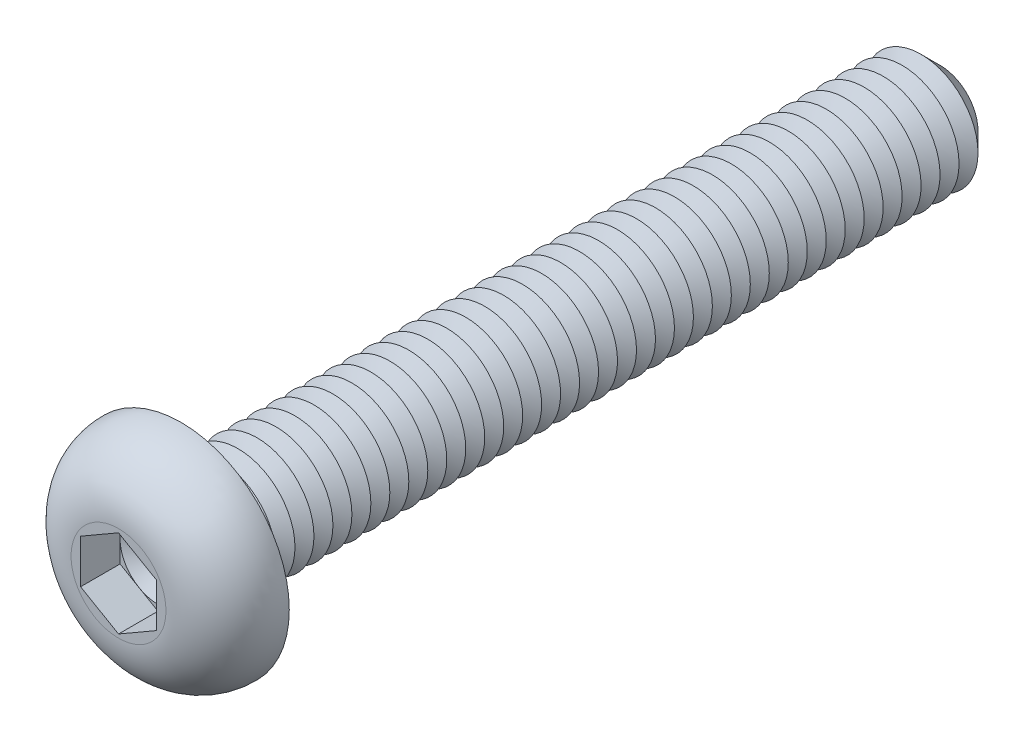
from build123d import *

# Parameters (mm, degrees)
CUT_EXTRUDE1_DEPTH  = 1.04
SKETCH4_R           = 1.5
BOSS_EXTRUDE1_DEPTH = 20
CHAMFER1_SIZE       = 0.5
LPATTERN1_COUNT     = 38
LPATTERN1_PITCH     = 0.5
FILLET2_R           = 0.2


with BuildPart() as part:
    # Sketch2 → Revolve1 (revolve)
    with BuildSketch(Plane(origin=(0, 0, 0), x_dir=(0, 0, -1), z_dir=(1, 0, 0)), mode=Mode.PRIVATE) as revolve1_sk:
        with BuildLine():
            Line((0, 0), (-1.65, 0))
            Line((-1.65, 0), (-1.65, 1.250781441))
            ThreePointArc((-1.65, 1.250781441), (-1.163552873, 2.39969397), (0, 2.85))
            Line((0, 2.85), (0, 0))
        make_face()
    revolve(revolve1_sk.sketch.rotate(Axis((0, 0, 47.934239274), (0, 0, -1)), 90), axis=Axis((0, 0, 47.934239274), (0, 0, -1)))

    # Sketch3 → Cut-Extrude1 (cut)
    with BuildSketch(Plane.XY.offset(1.65)):
        Polygon((0, 1.154700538), (-1, 0.577350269), (-1, -0.577350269), (0, -1.154700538), (1, -0.577350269), (1, 0.577350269), align=None)
    extrude(amount=-CUT_EXTRUDE1_DEPTH, mode=Mode.SUBTRACT)

    # Sketch4 → Boss-Extrude1 (add)
    with BuildSketch(Plane(origin=(0, 0, 0), x_dir=(-1, 0, 0), z_dir=(0, 0, -1))):
        with Locations(Location((0, 0, 0), (0, 0, 180))):
            Circle(SKETCH4_R)
    extrude(amount=BOSS_EXTRUDE1_DEPTH)

    # Chamfer1
    chamfer1_edges = [part.edges().sort_by_distance(p)[0] for p in [
        (-1.5, 0, -20),
    ]]
    chamfer(chamfer1_edges, length=CHAMFER1_SIZE)

    # Sketch5 → Cut-Revolve1 (revolve, cut)
    with BuildSketch(Plane(origin=(0, 0, 0), x_dir=(0, 0, -1), z_dir=(1, 0, 0)), mode=Mode.PRIVATE) as cut_revolve1_sk:
        Polygon((0.5, 1.5), (1, 1.5), (0.75, 1.066987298), align=None)
    cut_revolve1 = revolve(cut_revolve1_sk.sketch.rotate(Axis((0, 0, 47.934239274), (0, 0, -1)), 90), axis=Axis((0, 0, 47.934239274), (0, 0, -1)), mode=Mode.SUBTRACT)

    # LPattern1: Cut-Revolve1 ×38
    with Locations(*[(0, 0, -i * LPATTERN1_PITCH) for i in range(1, LPATTERN1_COUNT)]):
        add(cut_revolve1, mode=Mode.SUBTRACT)

    # Fillet2
    fillet2_edges = [part.edges().sort_by_distance(p)[0] for p in [
        (-1.5, 0, 0),
    ]]
    fillet(fillet2_edges, radius=FILLET2_R)

    # Cut-Extrude2 cone 1 section (on through the dimple's axis) → Cut-Extrude2 (revolve, cut)
    with BuildSketch(Plane(origin=(0, 0, 0.61), x_dir=(0, -1, 0), z_dir=(1, 0, 0))):
        Polygon((0, 0), (1, 0), (0, 0.577350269), align=None)
    revolve(axis=Axis((0, 0, 0.61), (0, 0, -1)), mode=Mode.SUBTRACT)


solid = part.part
